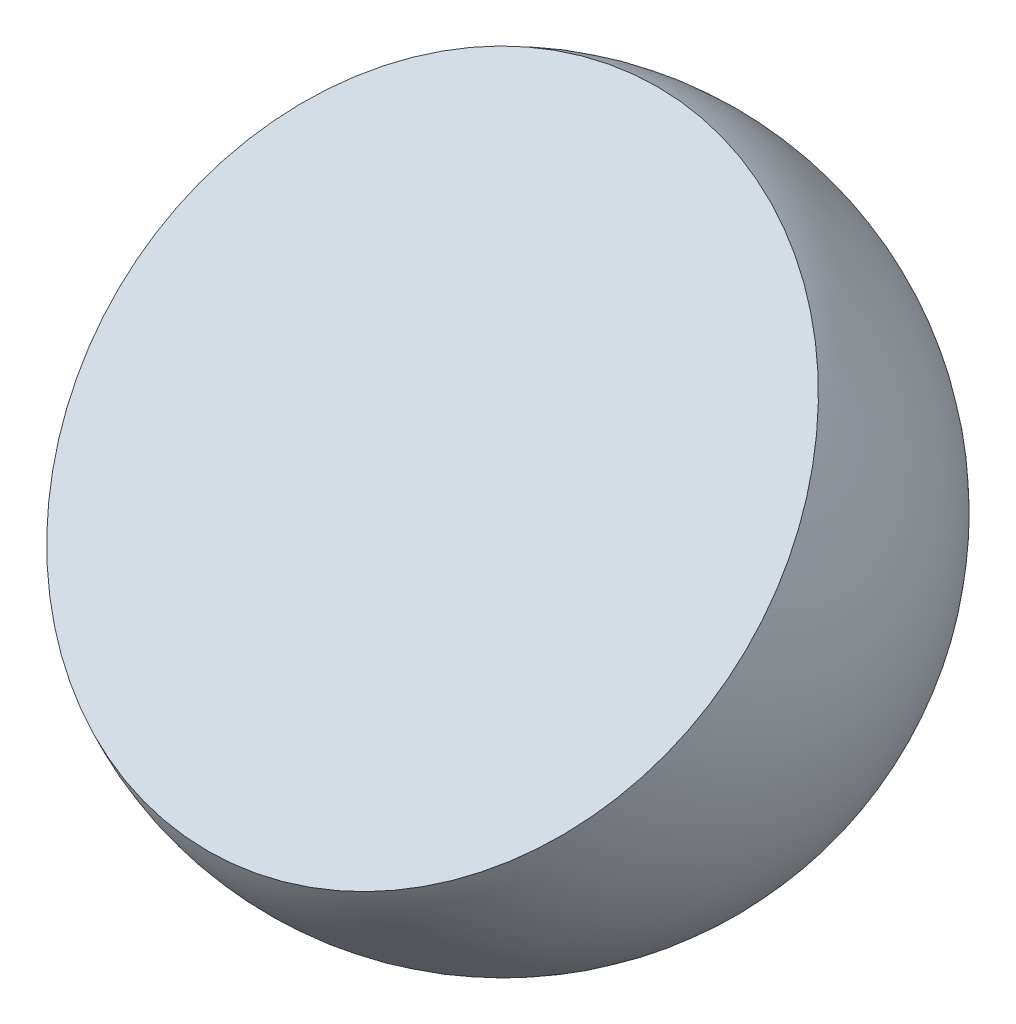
ISO-10303-21;
HEADER;
FILE_DESCRIPTION(('STEP AP214'),'2;1');
FILE_NAME('part.step','',(''),(''),'','','');
FILE_SCHEMA(('AUTOMOTIVE_DESIGN { 1 0 10303 214 1 1 1 1 }'));
ENDSEC;
DATA;
#1=APPLICATION_CONTEXT('core data for automotive mechanical design processes');
#2=APPLICATION_PROTOCOL_DEFINITION('international standard','automotive_design',2000,#1);
#3=PRODUCT_CONTEXT('',#1,'mechanical');
#4=PRODUCT('Part','Part','',(#3));
#5=PRODUCT_RELATED_PRODUCT_CATEGORY('part','',(#4));
#6=PRODUCT_DEFINITION_FORMATION('','',#4);
#7=PRODUCT_DEFINITION_CONTEXT('part definition',#1,'design');
#8=PRODUCT_DEFINITION('design','',#6,#7);
#9=PRODUCT_DEFINITION_SHAPE('','',#8);
#10=(LENGTH_UNIT() NAMED_UNIT(*) SI_UNIT(.MILLI.,.METRE.));
#11=(NAMED_UNIT(*) PLANE_ANGLE_UNIT() SI_UNIT($,.RADIAN.));
#12=(NAMED_UNIT(*) SI_UNIT($,.STERADIAN.) SOLID_ANGLE_UNIT());
#13=UNCERTAINTY_MEASURE_WITH_UNIT(LENGTH_MEASURE(1.E-05),#10,'distance_accuracy_value','');
#14=(GEOMETRIC_REPRESENTATION_CONTEXT(3) GLOBAL_UNCERTAINTY_ASSIGNED_CONTEXT((#13)) GLOBAL_UNIT_ASSIGNED_CONTEXT((#10,
#11,#12)) REPRESENTATION_CONTEXT('',''));
#15=CARTESIAN_POINT('',(0.,0.,0.));
#16=DIRECTION('',(0.,0.,1.));
#17=DIRECTION('',(1.,0.,0.));
#18=AXIS2_PLACEMENT_3D('',#15,#16,#17);
#19=CARTESIAN_POINT('',(0.,0.,0.));
#20=DIRECTION('',(0.,1.,0.));
#21=DIRECTION('',(0.,0.,-1.));
#22=AXIS2_PLACEMENT_3D('',#19,#20,#21);
#23=SPHERICAL_SURFACE('',#22,30.);
#24=CARTESIAN_POINT('',(0.,0.,0.));
#25=DIRECTION('',(0.,-0.717250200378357,-0.696815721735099));
#26=DIRECTION('',(0.,0.696815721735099,-0.717250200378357));
#27=AXIS2_PLACEMENT_3D('',#24,#25,#26);
#28=SPHERICAL_SURFACE('',#27,30.);
#29=CARTESIAN_POINT('',(0.,6.62006517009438,6.43145932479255));
#30=DIRECTION('',(0.,-0.717250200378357,-0.696815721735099));
#31=DIRECTION('',(0.,0.696815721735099,-0.717250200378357));
#32=AXIS2_PLACEMENT_3D('',#29,#30,#31);
#33=CIRCLE('',#32,28.5448956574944);
#34=CARTESIAN_POINT('',(0.,26.5105972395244,-14.0423728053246));
#35=VERTEX_POINT('',#34);
#36=EDGE_CURVE('E10',#35,#35,#33,.T.);
#37=ORIENTED_EDGE('',*,*,#36,.T.);
#38=EDGE_LOOP('',(#37));
#39=FACE_BOUND('',#38,.T.);
#40=ADVANCED_FACE('F41',(#39),#28,.T.);
#41=CARTESIAN_POINT('',(-30.,33.9011893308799,-21.649697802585));
#42=DIRECTION('',(0.,-0.717250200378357,-0.696815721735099));
#43=DIRECTION('',(0.,0.696815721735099,-0.717250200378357));
#44=AXIS2_PLACEMENT_3D('',#41,#42,#43);
#45=PLANE('',#44);
#46=ORIENTED_EDGE('',*,*,#36,.F.);
#47=EDGE_LOOP('',(#46));
#48=FACE_BOUND('',#47,.T.);
#49=ADVANCED_FACE('F50',(#48),#45,.F.);
#50=CLOSED_SHELL('',(#40,#49));
#51=MANIFOLD_SOLID_BREP('B2',#50);
#52=ADVANCED_BREP_SHAPE_REPRESENTATION('',(#18,#51),#14);
#53=SHAPE_DEFINITION_REPRESENTATION(#9,#52);
ENDSEC;
END-ISO-10303-21;
